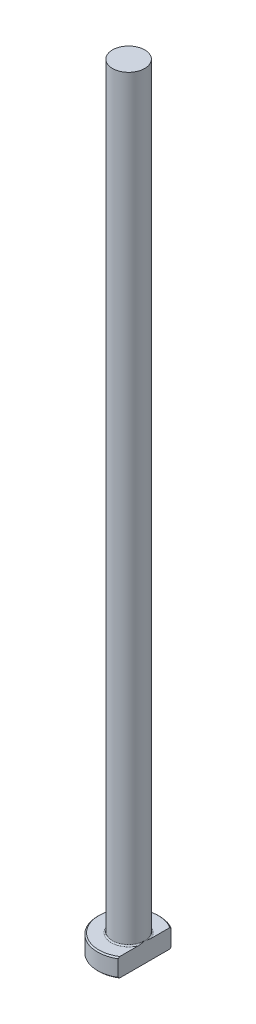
from build123d import *
from build123d.topology import SkipClean

# Parameters (mm, degrees)
CHAMFER1_SIZE = 0.2
FILLET1_R     = 0.2
KEY_DEPTH     = 126.199840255


with BuildPart() as part:
    # Sketch1 → Revolve1 (revolve)
    with BuildSketch(Plane.XY, mode=Mode.PRIVATE) as revolve1_sk:
        Polygon((0, 0), (-5, 0), (-5, 3), (-2.6, 3), (-2.6, 125), (0, 125), align=None)
    revolve(revolve1_sk.sketch.rotate(Axis((0, 259.958771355, 0), (0, -1, 0)), 270), axis=Axis((0, 259.958771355, 0), (0, -1, 0)))

    # Chamfer1
    chamfer1_edges = [part.edges().sort_by_distance(p)[0] for p in [
        (0, 3, -5),
        (0, 0, -5),
    ]]
    chamfer(chamfer1_edges, length=CHAMFER1_SIZE)

    # Fillet1
    fillet1_edges = [part.edges().sort_by_distance(p)[0] for p in [
        (0, 3, -2.6),
    ]]
    fillet(fillet1_edges, radius=FILLET1_R)

    # Sketch2 → KEY (cut, through all)
    with SkipClean():  # the faces are left unmerged after this step: merging them gives an invalid solid
        with BuildSketch(Plane(origin=(0, 0, 0), x_dir=(1, 0, 0), z_dir=(0, 1, 0))):
            with BuildLine():
                Line((2.6, 4.270831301), (2.6, -4.270831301))
                ThreePointArc((2.6, -4.270831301), (5, 0), (2.6, 4.270831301))
            make_face()
        extrude(amount=KEY_DEPTH, mode=Mode.SUBTRACT)


solid = part.part
